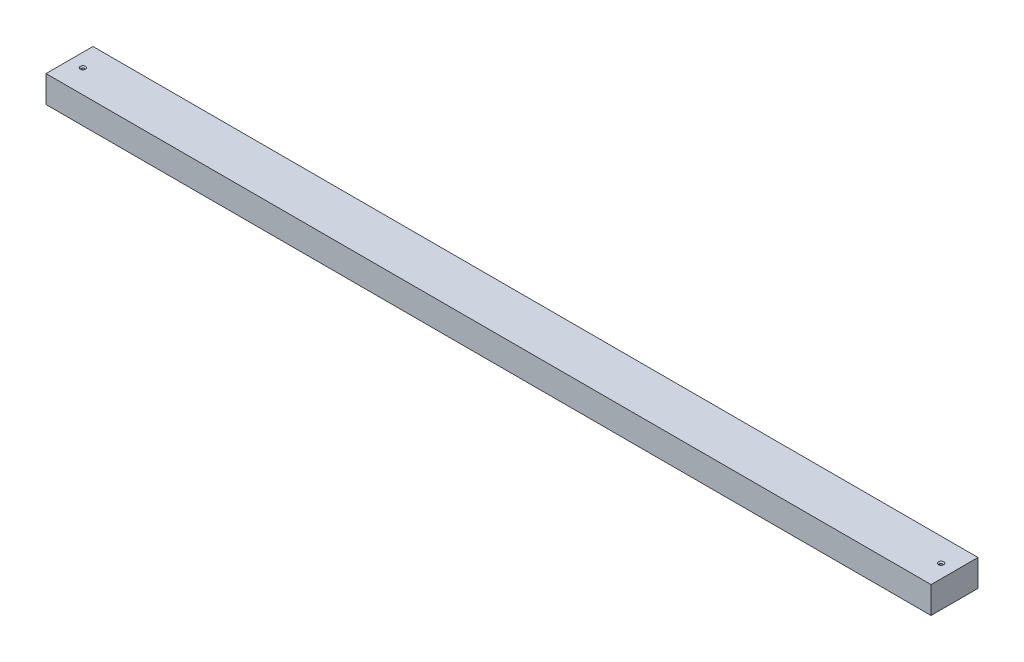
ISO-10303-21;
HEADER;
FILE_DESCRIPTION(('STEP AP214'),'2;1');
FILE_NAME('part.step','',(''),(''),'','','');
FILE_SCHEMA(('AUTOMOTIVE_DESIGN { 1 0 10303 214 1 1 1 1 }'));
ENDSEC;
DATA;
#1=APPLICATION_CONTEXT('core data for automotive mechanical design processes');
#2=APPLICATION_PROTOCOL_DEFINITION('international standard','automotive_design',2000,#1);
#3=PRODUCT_CONTEXT('',#1,'mechanical');
#4=PRODUCT('Part','Part','',(#3));
#5=PRODUCT_RELATED_PRODUCT_CATEGORY('part','',(#4));
#6=PRODUCT_DEFINITION_FORMATION('','',#4);
#7=PRODUCT_DEFINITION_CONTEXT('part definition',#1,'design');
#8=PRODUCT_DEFINITION('design','',#6,#7);
#9=PRODUCT_DEFINITION_SHAPE('','',#8);
#10=(LENGTH_UNIT() NAMED_UNIT(*) SI_UNIT(.MILLI.,.METRE.));
#11=(NAMED_UNIT(*) PLANE_ANGLE_UNIT() SI_UNIT($,.RADIAN.));
#12=(NAMED_UNIT(*) SI_UNIT($,.STERADIAN.) SOLID_ANGLE_UNIT());
#13=UNCERTAINTY_MEASURE_WITH_UNIT(LENGTH_MEASURE(1.E-05),#10,'distance_accuracy_value','');
#14=(GEOMETRIC_REPRESENTATION_CONTEXT(3) GLOBAL_UNCERTAINTY_ASSIGNED_CONTEXT((#13)) GLOBAL_UNIT_ASSIGNED_CONTEXT((#10,
#11,#12)) REPRESENTATION_CONTEXT('',''));
#15=CARTESIAN_POINT('',(0.,0.,0.));
#16=DIRECTION('',(0.,0.,1.));
#17=DIRECTION('',(1.,0.,0.));
#18=AXIS2_PLACEMENT_3D('',#15,#16,#17);
#19=CARTESIAN_POINT('',(838.2,50.8,-44.45));
#20=DIRECTION('',(-1.,0.,0.));
#21=DIRECTION('',(0.,0.,1.));
#22=AXIS2_PLACEMENT_3D('',#19,#20,#21);
#23=PLANE('',#22);
#24=DIRECTION('',(0.,0.,-1.));
#25=VECTOR('',#24,1.);
#26=CARTESIAN_POINT('',(838.2,0.,-44.45));
#27=LINE('',#26,#25);
#28=CARTESIAN_POINT('',(838.2,0.,44.45));
#29=VERTEX_POINT('',#28);
#30=CARTESIAN_POINT('',(838.2,0.,-44.45));
#31=VERTEX_POINT('',#30);
#32=EDGE_CURVE('E95',#29,#31,#27,.T.);
#33=ORIENTED_EDGE('',*,*,#32,.T.);
#34=DIRECTION('',(0.,-1.,0.));
#35=VECTOR('',#34,1.);
#36=CARTESIAN_POINT('',(838.2,50.8,-44.45));
#37=LINE('',#36,#35);
#38=CARTESIAN_POINT('',(838.2,50.8,-44.45));
#39=VERTEX_POINT('',#38);
#40=EDGE_CURVE('E11',#39,#31,#37,.T.);
#41=ORIENTED_EDGE('',*,*,#40,.F.);
#42=DIRECTION('',(0.,0.,-1.));
#43=VECTOR('',#42,1.);
#44=CARTESIAN_POINT('',(838.2,50.8,-44.45));
#45=LINE('',#44,#43);
#46=CARTESIAN_POINT('',(838.2,50.8,44.45));
#47=VERTEX_POINT('',#46);
#48=EDGE_CURVE('E83',#47,#39,#45,.T.);
#49=ORIENTED_EDGE('',*,*,#48,.F.);
#50=DIRECTION('',(0.,-1.,0.));
#51=VECTOR('',#50,1.);
#52=CARTESIAN_POINT('',(838.2,50.8,44.45));
#53=LINE('',#52,#51);
#54=EDGE_CURVE('E91',#47,#29,#53,.T.);
#55=ORIENTED_EDGE('',*,*,#54,.T.);
#56=EDGE_LOOP('',(#33,#41,#49,#55));
#57=FACE_BOUND('',#56,.T.);
#58=ADVANCED_FACE('F32',(#57),#23,.F.);
#59=CARTESIAN_POINT('',(-838.2,50.8,-44.45));
#60=DIRECTION('',(0.,0.,1.));
#61=DIRECTION('',(1.,0.,0.));
#62=AXIS2_PLACEMENT_3D('',#59,#60,#61);
#63=PLANE('',#62);
#64=DIRECTION('',(-1.,0.,0.));
#65=VECTOR('',#64,1.);
#66=CARTESIAN_POINT('',(-838.2,0.,-44.45));
#67=LINE('',#66,#65);
#68=CARTESIAN_POINT('',(-838.2,0.,-44.45));
#69=VERTEX_POINT('',#68);
#70=EDGE_CURVE('E87',#31,#69,#67,.T.);
#71=ORIENTED_EDGE('',*,*,#70,.T.);
#72=DIRECTION('',(0.,-1.,0.));
#73=VECTOR('',#72,1.);
#74=CARTESIAN_POINT('',(-838.2,50.8,-44.45));
#75=LINE('',#74,#73);
#76=CARTESIAN_POINT('',(-838.2,50.8,-44.45));
#77=VERTEX_POINT('',#76);
#78=EDGE_CURVE('E40',#77,#69,#75,.T.);
#79=ORIENTED_EDGE('',*,*,#78,.F.);
#80=DIRECTION('',(-1.,0.,0.));
#81=VECTOR('',#80,1.);
#82=CARTESIAN_POINT('',(-838.2,50.8,-44.45));
#83=LINE('',#82,#81);
#84=EDGE_CURVE('E78',#39,#77,#83,.T.);
#85=ORIENTED_EDGE('',*,*,#84,.F.);
#86=ORIENTED_EDGE('',*,*,#40,.T.);
#87=EDGE_LOOP('',(#71,#79,#85,#86));
#88=FACE_BOUND('',#87,.T.);
#89=ADVANCED_FACE('F86',(#88),#63,.F.);
#90=CARTESIAN_POINT('',(-838.2,50.8,-44.45));
#91=DIRECTION('',(1.,0.,0.));
#92=DIRECTION('',(0.,0.,-1.));
#93=AXIS2_PLACEMENT_3D('',#90,#91,#92);
#94=PLANE('',#93);
#95=DIRECTION('',(0.,0.,1.));
#96=VECTOR('',#95,1.);
#97=CARTESIAN_POINT('',(-838.2,0.,-44.45));
#98=LINE('',#97,#96);
#99=CARTESIAN_POINT('',(-838.2,0.,44.45));
#100=VERTEX_POINT('',#99);
#101=EDGE_CURVE('E65',#69,#100,#98,.T.);
#102=ORIENTED_EDGE('',*,*,#101,.T.);
#103=DIRECTION('',(0.,-1.,0.));
#104=VECTOR('',#103,1.);
#105=CARTESIAN_POINT('',(-838.2,50.8,44.45));
#106=LINE('',#105,#104);
#107=CARTESIAN_POINT('',(-838.2,50.8,44.45));
#108=VERTEX_POINT('',#107);
#109=EDGE_CURVE('E88',#108,#100,#106,.T.);
#110=ORIENTED_EDGE('',*,*,#109,.F.);
#111=DIRECTION('',(0.,0.,1.));
#112=VECTOR('',#111,1.);
#113=CARTESIAN_POINT('',(-838.2,50.8,-44.45));
#114=LINE('',#113,#112);
#115=EDGE_CURVE('E81',#77,#108,#114,.T.);
#116=ORIENTED_EDGE('',*,*,#115,.F.);
#117=ORIENTED_EDGE('',*,*,#78,.T.);
#118=EDGE_LOOP('',(#102,#110,#116,#117));
#119=FACE_BOUND('',#118,.T.);
#120=ADVANCED_FACE('F89',(#119),#94,.F.);
#121=CARTESIAN_POINT('',(-838.2,50.8,44.45));
#122=DIRECTION('',(0.,0.,-1.));
#123=DIRECTION('',(-1.,0.,0.));
#124=AXIS2_PLACEMENT_3D('',#121,#122,#123);
#125=PLANE('',#124);
#126=DIRECTION('',(1.,0.,0.));
#127=VECTOR('',#126,1.);
#128=CARTESIAN_POINT('',(-838.2,0.,44.45));
#129=LINE('',#128,#127);
#130=EDGE_CURVE('E71',#100,#29,#129,.T.);
#131=ORIENTED_EDGE('',*,*,#130,.T.);
#132=ORIENTED_EDGE('',*,*,#54,.F.);
#133=DIRECTION('',(1.,0.,0.));
#134=VECTOR('',#133,1.);
#135=CARTESIAN_POINT('',(-838.2,50.8,44.45));
#136=LINE('',#135,#134);
#137=EDGE_CURVE('E48',#108,#47,#136,.T.);
#138=ORIENTED_EDGE('',*,*,#137,.F.);
#139=ORIENTED_EDGE('',*,*,#109,.T.);
#140=EDGE_LOOP('',(#131,#132,#138,#139));
#141=FACE_BOUND('',#140,.T.);
#142=ADVANCED_FACE('F103',(#141),#125,.F.);
#143=CARTESIAN_POINT('',(0.,50.8,0.));
#144=DIRECTION('',(0.,1.,0.));
#145=DIRECTION('',(0.,0.,1.));
#146=AXIS2_PLACEMENT_3D('',#143,#144,#145);
#147=PLANE('',#146);
#148=CARTESIAN_POINT('',(-812.8,50.8,0.));
#149=DIRECTION('',(0.,1.,0.));
#150=DIRECTION('',(0.,0.,1.));
#151=AXIS2_PLACEMENT_3D('',#148,#149,#150);
#152=CIRCLE('',#151,4.88949999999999);
#153=CARTESIAN_POINT('',(-812.8,50.8,4.88949999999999));
#154=VERTEX_POINT('',#153);
#155=EDGE_CURVE('E123',#154,#154,#152,.T.);
#156=ORIENTED_EDGE('',*,*,#155,.F.);
#157=EDGE_LOOP('',(#156));
#158=FACE_BOUND('',#157,.T.);
#159=CARTESIAN_POINT('',(812.8,50.8,0.));
#160=DIRECTION('',(0.,1.,0.));
#161=DIRECTION('',(0.,0.,1.));
#162=AXIS2_PLACEMENT_3D('',#159,#160,#161);
#163=CIRCLE('',#162,4.88949999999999);
#164=CARTESIAN_POINT('',(812.8,50.8,4.88949999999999));
#165=VERTEX_POINT('',#164);
#166=EDGE_CURVE('E114',#165,#165,#163,.T.);
#167=ORIENTED_EDGE('',*,*,#166,.F.);
#168=EDGE_LOOP('',(#167));
#169=FACE_BOUND('',#168,.T.);
#170=ORIENTED_EDGE('',*,*,#48,.T.);
#171=ORIENTED_EDGE('',*,*,#84,.T.);
#172=ORIENTED_EDGE('',*,*,#115,.T.);
#173=ORIENTED_EDGE('',*,*,#137,.T.);
#174=EDGE_LOOP('',(#170,#171,#172,#173));
#175=FACE_BOUND('',#174,.T.);
#176=ADVANCED_FACE('F79',(#158,#169,#175),#147,.T.);
#177=CARTESIAN_POINT('',(0.,0.,0.));
#178=DIRECTION('',(0.,1.,0.));
#179=DIRECTION('',(0.,0.,1.));
#180=AXIS2_PLACEMENT_3D('',#177,#178,#179);
#181=PLANE('',#180);
#182=CARTESIAN_POINT('',(-812.8,0.,0.));
#183=DIRECTION('',(0.,1.,0.));
#184=DIRECTION('',(0.,0.,1.));
#185=AXIS2_PLACEMENT_3D('',#182,#183,#184);
#186=CIRCLE('',#185,2.55269999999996);
#187=CARTESIAN_POINT('',(-812.8,0.,2.55269999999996));
#188=VERTEX_POINT('',#187);
#189=EDGE_CURVE('E117',#188,#188,#186,.T.);
#190=ORIENTED_EDGE('',*,*,#189,.T.);
#191=EDGE_LOOP('',(#190));
#192=FACE_BOUND('',#191,.T.);
#193=CARTESIAN_POINT('',(812.8,0.,0.));
#194=DIRECTION('',(0.,1.,0.));
#195=DIRECTION('',(0.,0.,1.));
#196=AXIS2_PLACEMENT_3D('',#193,#194,#195);
#197=CIRCLE('',#196,2.55269999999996);
#198=CARTESIAN_POINT('',(812.8,0.,2.55269999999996));
#199=VERTEX_POINT('',#198);
#200=EDGE_CURVE('E98',#199,#199,#197,.T.);
#201=ORIENTED_EDGE('',*,*,#200,.T.);
#202=EDGE_LOOP('',(#201));
#203=FACE_BOUND('',#202,.T.);
#204=ORIENTED_EDGE('',*,*,#32,.F.);
#205=ORIENTED_EDGE('',*,*,#130,.F.);
#206=ORIENTED_EDGE('',*,*,#101,.F.);
#207=ORIENTED_EDGE('',*,*,#70,.F.);
#208=EDGE_LOOP('',(#204,#205,#206,#207));
#209=FACE_BOUND('',#208,.T.);
#210=ADVANCED_FACE('F106',(#192,#203,#209),#181,.F.);
#211=CARTESIAN_POINT('',(812.8,50.8,0.));
#212=DIRECTION('',(0.,1.,0.));
#213=DIRECTION('',(0.,0.,1.));
#214=AXIS2_PLACEMENT_3D('',#211,#212,#213);
#215=CYLINDRICAL_SURFACE('',#214,2.55269999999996);
#216=ORIENTED_EDGE('',*,*,#200,.F.);
#217=EDGE_LOOP('',(#216));
#218=FACE_BOUND('',#217,.T.);
#219=CARTESIAN_POINT('',(812.8,48.8391919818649,0.));
#220=DIRECTION('',(0.,1.,0.));
#221=DIRECTION('',(0.,0.,1.));
#222=AXIS2_PLACEMENT_3D('',#219,#220,#221);
#223=CIRCLE('',#222,2.55269999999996);
#224=CARTESIAN_POINT('',(812.8,48.8391919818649,2.55269999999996));
#225=VERTEX_POINT('',#224);
#226=EDGE_CURVE('E111',#225,#225,#223,.T.);
#227=ORIENTED_EDGE('',*,*,#226,.T.);
#228=EDGE_LOOP('',(#227));
#229=FACE_BOUND('',#228,.T.);
#230=ADVANCED_FACE('F137',(#218,#229),#215,.F.);
#231=CARTESIAN_POINT('',(812.8,50.8,0.));
#232=DIRECTION('',(0.,1.,0.));
#233=DIRECTION('',(0.,0.,1.));
#234=AXIS2_PLACEMENT_3D('',#231,#232,#233);
#235=CONICAL_SURFACE('',#234,4.88949999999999,0.87266462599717);
#236=ORIENTED_EDGE('',*,*,#226,.F.);
#237=EDGE_LOOP('',(#236));
#238=FACE_BOUND('',#237,.T.);
#239=ORIENTED_EDGE('',*,*,#166,.T.);
#240=EDGE_LOOP('',(#239));
#241=FACE_BOUND('',#240,.T.);
#242=ADVANCED_FACE('F134',(#238,#241),#235,.F.);
#243=CARTESIAN_POINT('',(-812.8,50.8,0.));
#244=DIRECTION('',(0.,1.,0.));
#245=DIRECTION('',(0.,0.,1.));
#246=AXIS2_PLACEMENT_3D('',#243,#244,#245);
#247=CYLINDRICAL_SURFACE('',#246,2.55269999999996);
#248=ORIENTED_EDGE('',*,*,#189,.F.);
#249=EDGE_LOOP('',(#248));
#250=FACE_BOUND('',#249,.T.);
#251=CARTESIAN_POINT('',(-812.8,48.8391919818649,0.));
#252=DIRECTION('',(0.,1.,0.));
#253=DIRECTION('',(0.,0.,1.));
#254=AXIS2_PLACEMENT_3D('',#251,#252,#253);
#255=CIRCLE('',#254,2.55269999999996);
#256=CARTESIAN_POINT('',(-812.8,48.8391919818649,2.55269999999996));
#257=VERTEX_POINT('',#256);
#258=EDGE_CURVE('E120',#257,#257,#255,.T.);
#259=ORIENTED_EDGE('',*,*,#258,.T.);
#260=EDGE_LOOP('',(#259));
#261=FACE_BOUND('',#260,.T.);
#262=ADVANCED_FACE('F136',(#250,#261),#247,.F.);
#263=CARTESIAN_POINT('',(-812.8,50.8,0.));
#264=DIRECTION('',(0.,1.,0.));
#265=DIRECTION('',(0.,0.,1.));
#266=AXIS2_PLACEMENT_3D('',#263,#264,#265);
#267=CONICAL_SURFACE('',#266,4.88949999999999,0.87266462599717);
#268=ORIENTED_EDGE('',*,*,#258,.F.);
#269=EDGE_LOOP('',(#268));
#270=FACE_BOUND('',#269,.T.);
#271=ORIENTED_EDGE('',*,*,#155,.T.);
#272=EDGE_LOOP('',(#271));
#273=FACE_BOUND('',#272,.T.);
#274=ADVANCED_FACE('F127',(#270,#273),#267,.F.);
#275=CLOSED_SHELL('',(#58,#89,#120,#142,#176,#210,#230,#242,#262,#274));
#276=MANIFOLD_SOLID_BREP('B2',#275);
#277=ADVANCED_BREP_SHAPE_REPRESENTATION('',(#18,#276),#14);
#278=SHAPE_DEFINITION_REPRESENTATION(#9,#277);
ENDSEC;
END-ISO-10303-21;
